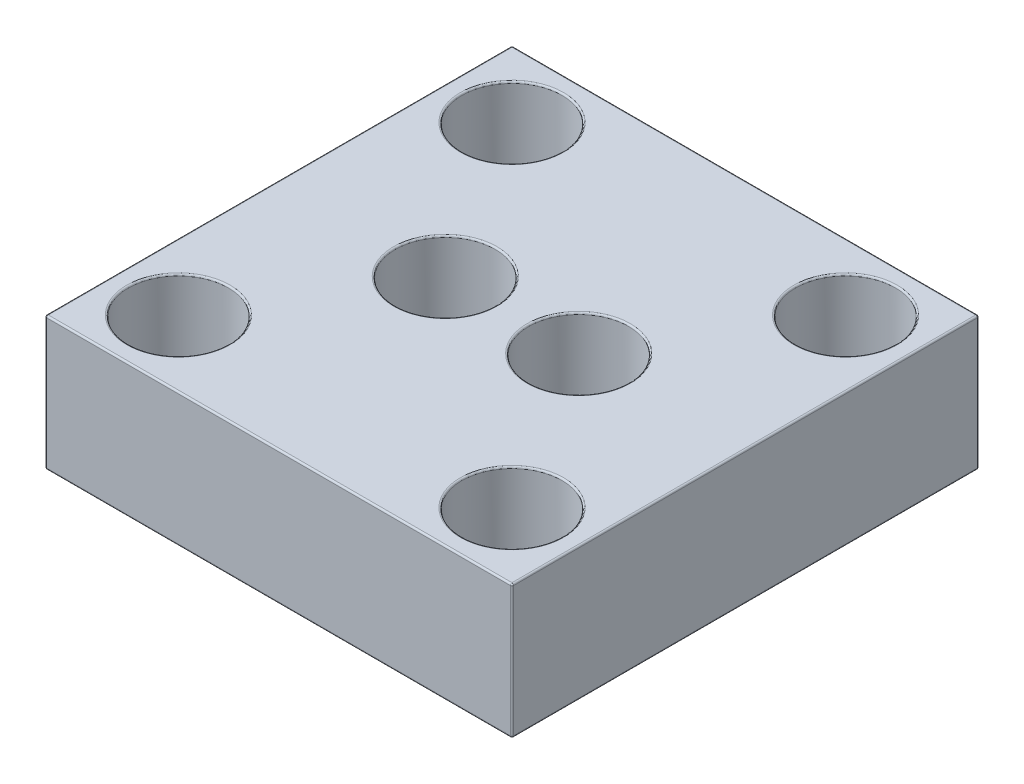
from build123d import *

# Parameters (mm, degrees)
SKETCH1_W           = 70
SKETCH1_H           = 70
BOSS_EXTRUDE1_DEPTH = 20
SKETCH2_R           = 4.5
CUT_EXTRUDE1_DEPTH  = 101.995049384
SKETCH3_R           = 7.5
CUT_EXTRUDE2_DEPTH  = 12
FILLET1_R           = 0.25


with BuildPart() as part:
    # Sketch1 → Boss-Extrude1 (new body)
    with BuildSketch(Plane(origin=(0, 0, 0), x_dir=(1, 0, 0), z_dir=(0, 1, 0))):
        with Locations((35, 35)):
            Rectangle(SKETCH1_W, SKETCH1_H)
    extrude(amount=BOSS_EXTRUDE1_DEPTH)

    # Sketch2 → Cut-Extrude1 (cut, through all)
    with BuildSketch(Plane(origin=(0, 20, 0), x_dir=(1, 0, 0), z_dir=(0, 1, 0))):
        with Locations(Location((10, 60, 0), (0, 0, 270))):
            Circle(SKETCH2_R)
        with Locations(Location((25, 35, 0), (0, 0, 270))):
            Circle(SKETCH2_R)
        with Locations(Location((10, 10, 0), (0, 0, 270))):
            Circle(SKETCH2_R)
        with Locations(Location((60, 10, 0), (0, 0, 90))):
            Circle(SKETCH2_R)
        with Locations(Location((45, 35, 0), (0, 0, 90))):
            Circle(SKETCH2_R)
        with Locations(Location((60, 60, 0), (0, 0, 90))):
            Circle(SKETCH2_R)
    extrude(amount=-CUT_EXTRUDE1_DEPTH, mode=Mode.SUBTRACT)

    # Sketch3 → Cut-Extrude2 (cut)
    with BuildSketch(Plane(origin=(0, 20, 0), x_dir=(1, 0, 0), z_dir=(0, 1, 0))):
        with Locations(Location((10, 60, 0), (0, 0, 270))):
            Circle(SKETCH3_R)
        with Locations(Location((25, 35, 0), (0, 0, 270))):
            Circle(SKETCH3_R)
        with Locations(Location((10, 10, 0), (0, 0, 270))):
            Circle(SKETCH3_R)
        with Locations(Location((45, 35, 0), (0, 0, 270))):
            Circle(SKETCH3_R)
        with Locations(Location((60, 60, 0), (0, 0, 270))):
            Circle(SKETCH3_R)
        with Locations(Location((60, 10, 0), (0, 0, 270))):
            Circle(SKETCH3_R)
    extrude(amount=-CUT_EXTRUDE2_DEPTH, mode=Mode.SUBTRACT)

    # Fillet1
    fillet1_edges = [part.edges().sort_by_distance(p)[0] for p in [
        (70, 20, -35),
        (35, 20, -70),
        (10, 0, -64.5),
        (25, 0, -39.5),
        (10, 0, -14.5),
        (60, 0, -5.5),
        (45, 0, -30.5),
        (60, 0, -55.5),
        (0, 20, -35),
        (10, 20, -67.5),
        (35, 0, -70),
        (25, 20, -42.5),
        (70, 0, -35),
        (10, 20, -17.5),
        (35, 0, 0),
        (45, 20, -42.5),
        (0, 0, -35),
        (60, 20, -67.5),
        (60, 20, -17.5),
        (35, 20, 0),
        (0, 10, -70),
        (70, 10, -70),
        (70, 10, 0),
        (0, 10, 0),
    ]]
    fillet(fillet1_edges, radius=FILLET1_R)


solid = part.part
